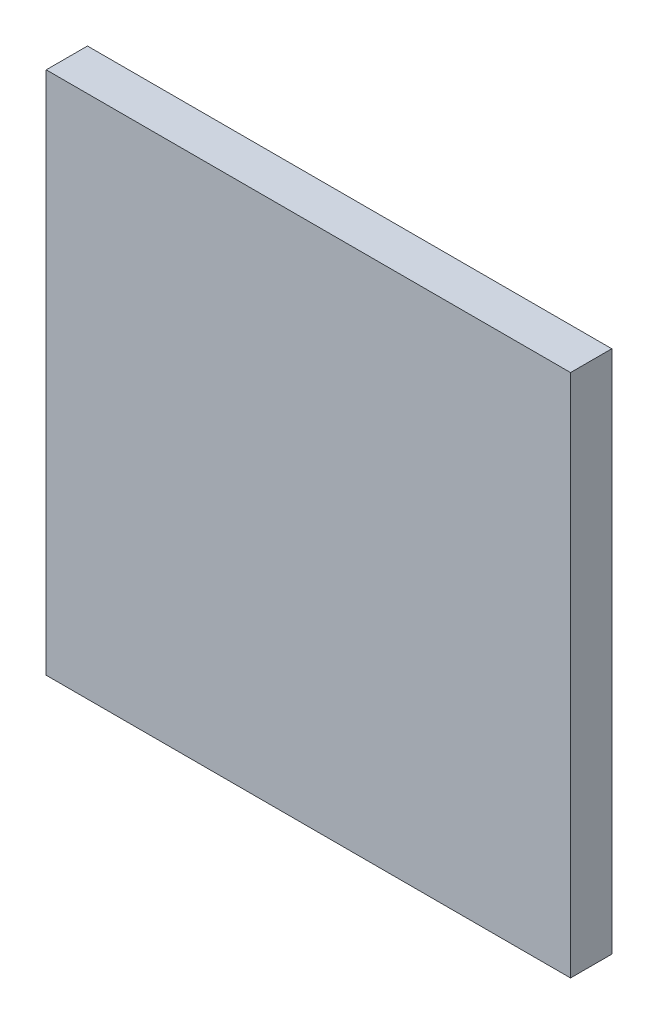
ISO-10303-21;
HEADER;
FILE_DESCRIPTION(('STEP AP214'),'2;1');
FILE_NAME('part.step','',(''),(''),'','','');
FILE_SCHEMA(('AUTOMOTIVE_DESIGN { 1 0 10303 214 1 1 1 1 }'));
ENDSEC;
DATA;
#1=APPLICATION_CONTEXT('core data for automotive mechanical design processes');
#2=APPLICATION_PROTOCOL_DEFINITION('international standard','automotive_design',2000,#1);
#3=PRODUCT_CONTEXT('',#1,'mechanical');
#4=PRODUCT('Part','Part','',(#3));
#5=PRODUCT_RELATED_PRODUCT_CATEGORY('part','',(#4));
#6=PRODUCT_DEFINITION_FORMATION('','',#4);
#7=PRODUCT_DEFINITION_CONTEXT('part definition',#1,'design');
#8=PRODUCT_DEFINITION('design','',#6,#7);
#9=PRODUCT_DEFINITION_SHAPE('','',#8);
#10=(LENGTH_UNIT() NAMED_UNIT(*) SI_UNIT(.MILLI.,.METRE.));
#11=(NAMED_UNIT(*) PLANE_ANGLE_UNIT() SI_UNIT($,.RADIAN.));
#12=(NAMED_UNIT(*) SI_UNIT($,.STERADIAN.) SOLID_ANGLE_UNIT());
#13=UNCERTAINTY_MEASURE_WITH_UNIT(LENGTH_MEASURE(1.E-05),#10,'distance_accuracy_value','');
#14=(GEOMETRIC_REPRESENTATION_CONTEXT(3) GLOBAL_UNCERTAINTY_ASSIGNED_CONTEXT((#13)) GLOBAL_UNIT_ASSIGNED_CONTEXT((#10,
#11,#12)) REPRESENTATION_CONTEXT('',''));
#15=CARTESIAN_POINT('',(0.,0.,0.));
#16=DIRECTION('',(0.,0.,1.));
#17=DIRECTION('',(1.,0.,0.));
#18=AXIS2_PLACEMENT_3D('',#15,#16,#17);
#19=CARTESIAN_POINT('',(0.,0.,2.9972));
#20=DIRECTION('',(1.,0.,0.));
#21=DIRECTION('',(0.,0.,-1.));
#22=AXIS2_PLACEMENT_3D('',#19,#20,#21);
#23=PLANE('',#22);
#24=DIRECTION('',(0.,-1.,0.));
#25=VECTOR('',#24,1.);
#26=CARTESIAN_POINT('',(0.,0.,0.));
#27=LINE('',#26,#25);
#28=CARTESIAN_POINT('',(0.,38.1,0.));
#29=VERTEX_POINT('',#28);
#30=CARTESIAN_POINT('',(0.,0.,0.));
#31=VERTEX_POINT('',#30);
#32=EDGE_CURVE('E107',#29,#31,#27,.T.);
#33=ORIENTED_EDGE('',*,*,#32,.T.);
#34=DIRECTION('',(0.,0.,-1.));
#35=VECTOR('',#34,1.);
#36=CARTESIAN_POINT('',(0.,0.,2.9972));
#37=LINE('',#36,#35);
#38=CARTESIAN_POINT('',(0.,0.,2.9972));
#39=VERTEX_POINT('',#38);
#40=EDGE_CURVE('E11',#39,#31,#37,.T.);
#41=ORIENTED_EDGE('',*,*,#40,.F.);
#42=DIRECTION('',(0.,-1.,0.));
#43=VECTOR('',#42,1.);
#44=CARTESIAN_POINT('',(0.,0.,2.9972));
#45=LINE('',#44,#43);
#46=CARTESIAN_POINT('',(0.,38.1,2.9972));
#47=VERTEX_POINT('',#46);
#48=EDGE_CURVE('E91',#47,#39,#45,.T.);
#49=ORIENTED_EDGE('',*,*,#48,.F.);
#50=DIRECTION('',(0.,0.,-1.));
#51=VECTOR('',#50,1.);
#52=CARTESIAN_POINT('',(0.,38.1,2.9972));
#53=LINE('',#52,#51);
#54=EDGE_CURVE('E103',#47,#29,#53,.T.);
#55=ORIENTED_EDGE('',*,*,#54,.T.);
#56=EDGE_LOOP('',(#33,#41,#49,#55));
#57=FACE_BOUND('',#56,.T.);
#58=ADVANCED_FACE('F39',(#57),#23,.F.);
#59=CARTESIAN_POINT('',(0.,0.,2.9972));
#60=DIRECTION('',(0.,1.,0.));
#61=DIRECTION('',(0.,0.,1.));
#62=AXIS2_PLACEMENT_3D('',#59,#60,#61);
#63=PLANE('',#62);
#64=DIRECTION('',(1.,0.,0.));
#65=VECTOR('',#64,1.);
#66=CARTESIAN_POINT('',(0.,0.,0.));
#67=LINE('',#66,#65);
#68=CARTESIAN_POINT('',(38.1,0.,0.));
#69=VERTEX_POINT('',#68);
#70=EDGE_CURVE('E96',#31,#69,#67,.T.);
#71=ORIENTED_EDGE('',*,*,#70,.T.);
#72=DIRECTION('',(0.,0.,-1.));
#73=VECTOR('',#72,1.);
#74=CARTESIAN_POINT('',(38.1,0.,2.9972));
#75=LINE('',#74,#73);
#76=CARTESIAN_POINT('',(38.1,0.,2.9972));
#77=VERTEX_POINT('',#76);
#78=EDGE_CURVE('E48',#77,#69,#75,.T.);
#79=ORIENTED_EDGE('',*,*,#78,.F.);
#80=DIRECTION('',(1.,0.,0.));
#81=VECTOR('',#80,1.);
#82=CARTESIAN_POINT('',(0.,0.,2.9972));
#83=LINE('',#82,#81);
#84=EDGE_CURVE('E86',#39,#77,#83,.T.);
#85=ORIENTED_EDGE('',*,*,#84,.F.);
#86=ORIENTED_EDGE('',*,*,#40,.T.);
#87=EDGE_LOOP('',(#71,#79,#85,#86));
#88=FACE_BOUND('',#87,.T.);
#89=ADVANCED_FACE('F95',(#88),#63,.F.);
#90=CARTESIAN_POINT('',(38.1,0.,2.9972));
#91=DIRECTION('',(-1.,0.,0.));
#92=DIRECTION('',(0.,0.,1.));
#93=AXIS2_PLACEMENT_3D('',#90,#91,#92);
#94=PLANE('',#93);
#95=DIRECTION('',(0.,1.,0.));
#96=VECTOR('',#95,1.);
#97=CARTESIAN_POINT('',(38.1,0.,0.));
#98=LINE('',#97,#96);
#99=CARTESIAN_POINT('',(38.1,38.1,0.));
#100=VERTEX_POINT('',#99);
#101=EDGE_CURVE('E73',#69,#100,#98,.T.);
#102=ORIENTED_EDGE('',*,*,#101,.T.);
#103=DIRECTION('',(0.,0.,-1.));
#104=VECTOR('',#103,1.);
#105=CARTESIAN_POINT('',(38.1,38.1,2.9972));
#106=LINE('',#105,#104);
#107=CARTESIAN_POINT('',(38.1,38.1,2.9972));
#108=VERTEX_POINT('',#107);
#109=EDGE_CURVE('E98',#108,#100,#106,.T.);
#110=ORIENTED_EDGE('',*,*,#109,.F.);
#111=DIRECTION('',(0.,1.,0.));
#112=VECTOR('',#111,1.);
#113=CARTESIAN_POINT('',(38.1,0.,2.9972));
#114=LINE('',#113,#112);
#115=EDGE_CURVE('E89',#77,#108,#114,.T.);
#116=ORIENTED_EDGE('',*,*,#115,.F.);
#117=ORIENTED_EDGE('',*,*,#78,.T.);
#118=EDGE_LOOP('',(#102,#110,#116,#117));
#119=FACE_BOUND('',#118,.T.);
#120=ADVANCED_FACE('F99',(#119),#94,.F.);
#121=CARTESIAN_POINT('',(0.,38.1,2.9972));
#122=DIRECTION('',(0.,-1.,0.));
#123=DIRECTION('',(0.,0.,-1.));
#124=AXIS2_PLACEMENT_3D('',#121,#122,#123);
#125=PLANE('',#124);
#126=DIRECTION('',(-1.,0.,0.));
#127=VECTOR('',#126,1.);
#128=CARTESIAN_POINT('',(0.,38.1,0.));
#129=LINE('',#128,#127);
#130=EDGE_CURVE('E79',#100,#29,#129,.T.);
#131=ORIENTED_EDGE('',*,*,#130,.T.);
#132=ORIENTED_EDGE('',*,*,#54,.F.);
#133=DIRECTION('',(-1.,0.,0.));
#134=VECTOR('',#133,1.);
#135=CARTESIAN_POINT('',(0.,38.1,2.9972));
#136=LINE('',#135,#134);
#137=EDGE_CURVE('E56',#108,#47,#136,.T.);
#138=ORIENTED_EDGE('',*,*,#137,.F.);
#139=ORIENTED_EDGE('',*,*,#109,.T.);
#140=EDGE_LOOP('',(#131,#132,#138,#139));
#141=FACE_BOUND('',#140,.T.);
#142=ADVANCED_FACE('F120',(#141),#125,.F.);
#143=CARTESIAN_POINT('',(0.,0.,2.9972));
#144=DIRECTION('',(0.,0.,-1.));
#145=DIRECTION('',(-1.,0.,0.));
#146=AXIS2_PLACEMENT_3D('',#143,#144,#145);
#147=PLANE('',#146);
#148=ORIENTED_EDGE('',*,*,#48,.T.);
#149=ORIENTED_EDGE('',*,*,#84,.T.);
#150=ORIENTED_EDGE('',*,*,#115,.T.);
#151=ORIENTED_EDGE('',*,*,#137,.T.);
#152=EDGE_LOOP('',(#148,#149,#150,#151));
#153=FACE_BOUND('',#152,.T.);
#154=ADVANCED_FACE('F87',(#153),#147,.F.);
#155=CARTESIAN_POINT('',(0.,0.,0.));
#156=DIRECTION('',(0.,0.,-1.));
#157=DIRECTION('',(-1.,0.,0.));
#158=AXIS2_PLACEMENT_3D('',#155,#156,#157);
#159=PLANE('',#158);
#160=ORIENTED_EDGE('',*,*,#32,.F.);
#161=ORIENTED_EDGE('',*,*,#130,.F.);
#162=ORIENTED_EDGE('',*,*,#101,.F.);
#163=ORIENTED_EDGE('',*,*,#70,.F.);
#164=EDGE_LOOP('',(#160,#161,#162,#163));
#165=FACE_BOUND('',#164,.T.);
#166=ADVANCED_FACE('F123',(#165),#159,.T.);
#167=CLOSED_SHELL('',(#58,#89,#120,#142,#154,#166));
#168=MANIFOLD_SOLID_BREP('B2',#167);
#169=ADVANCED_BREP_SHAPE_REPRESENTATION('',(#18,#168),#14);
#170=SHAPE_DEFINITION_REPRESENTATION(#9,#169);
ENDSEC;
END-ISO-10303-21;
